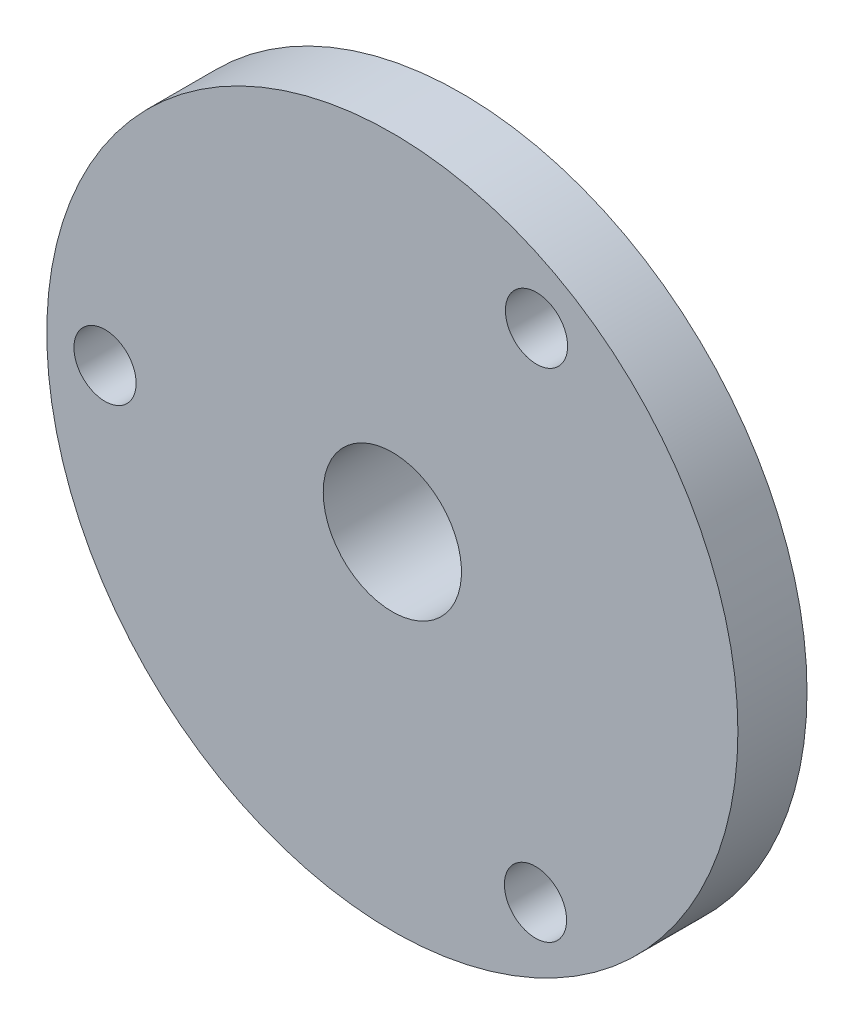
from build123d import *

# Parameters (mm, degrees)
SKETCH1_R           = 50
BOSS_EXTRUDE1_DEPTH = 10
SKETCH2_R           = 4.5
CUT_EXTRUDE2_DEPTH  = 10
SKETCH4_R           = 15
BOSS_EXTRUDE2_DEPTH = 10
SKETCH5_R           = 10
CUT_EXTRUDE3_DEPTH  = 20


with BuildPart() as part:
    # Sketch1 → Boss-Extrude1 (new body)
    with BuildSketch(Plane.XY):
        Circle(SKETCH1_R)
    extrude(amount=BOSS_EXTRUDE1_DEPTH)

    # Sketch2 → Cut-Extrude2 (cut)
    with BuildSketch(Plane(origin=(0, 0, 0), x_dir=(-1, 0, 0), z_dir=(0, 0, -1))):
        with Locations((41.569137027, 0.082745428)):
            Circle(SKETCH2_R)
        with Locations((-20.856228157, 35.958555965)):
            Circle(SKETCH2_R)
        with Locations((-20.712908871, -36.041301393)):
            Circle(SKETCH2_R)
    extrude(amount=-CUT_EXTRUDE2_DEPTH, mode=Mode.SUBTRACT)

    # Sketch4 → Boss-Extrude2 (add)
    with BuildSketch(Plane(origin=(0, 0, 0), x_dir=(-1, 0, 0), z_dir=(0, 0, -1))):
        with Locations(Location((0, 0, 0), (0, 0, 180))):
            Circle(SKETCH4_R)
    extrude(amount=BOSS_EXTRUDE2_DEPTH)

    # Sketch5 → Cut-Extrude3 (cut)
    with BuildSketch(Plane(origin=(0, 0, -10), x_dir=(-1, 0, 0), z_dir=(0, 0, -1))):
        Circle(SKETCH5_R)
    extrude(amount=-CUT_EXTRUDE3_DEPTH, mode=Mode.SUBTRACT)


solid = part.part
